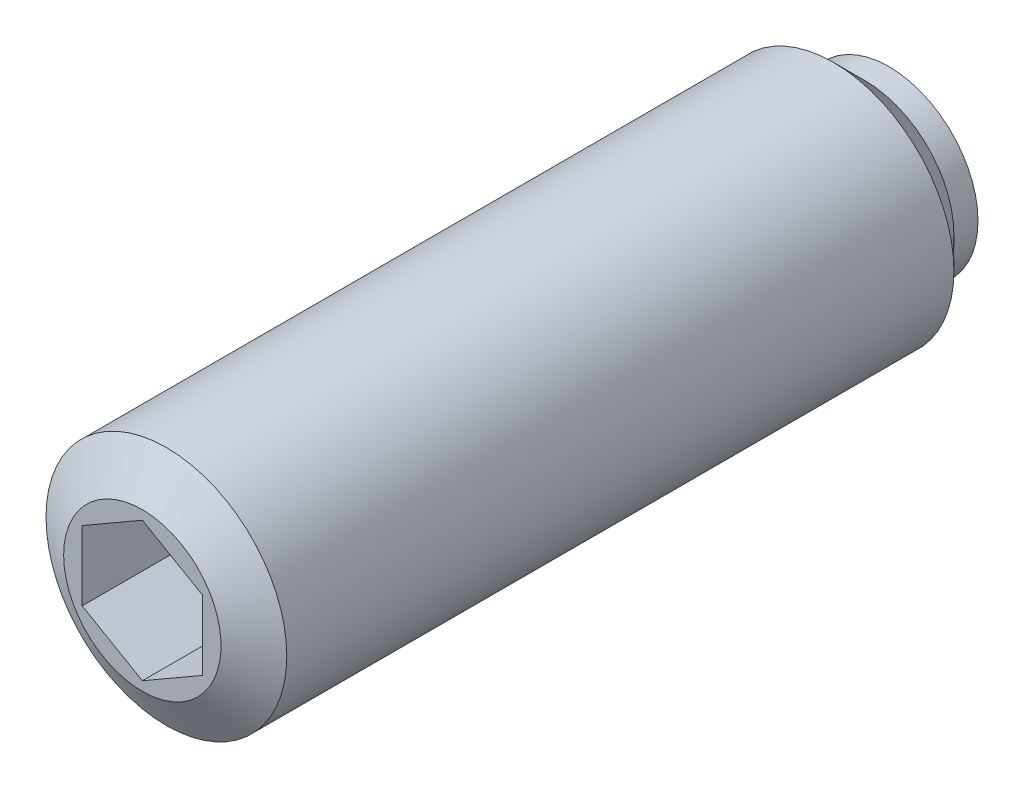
ISO-10303-21;
HEADER;
FILE_DESCRIPTION(('STEP AP214'),'2;1');
FILE_NAME('part.step','',(''),(''),'','','');
FILE_SCHEMA(('AUTOMOTIVE_DESIGN { 1 0 10303 214 1 1 1 1 }'));
ENDSEC;
DATA;
#1=APPLICATION_CONTEXT('core data for automotive mechanical design processes');
#2=APPLICATION_PROTOCOL_DEFINITION('international standard','automotive_design',2000,#1);
#3=PRODUCT_CONTEXT('',#1,'mechanical');
#4=PRODUCT('Part','Part','',(#3));
#5=PRODUCT_RELATED_PRODUCT_CATEGORY('part','',(#4));
#6=PRODUCT_DEFINITION_FORMATION('','',#4);
#7=PRODUCT_DEFINITION_CONTEXT('part definition',#1,'design');
#8=PRODUCT_DEFINITION('design','',#6,#7);
#9=PRODUCT_DEFINITION_SHAPE('','',#8);
#10=(LENGTH_UNIT() NAMED_UNIT(*) SI_UNIT(.MILLI.,.METRE.));
#11=(NAMED_UNIT(*) PLANE_ANGLE_UNIT() SI_UNIT($,.RADIAN.));
#12=(NAMED_UNIT(*) SI_UNIT($,.STERADIAN.) SOLID_ANGLE_UNIT());
#13=UNCERTAINTY_MEASURE_WITH_UNIT(LENGTH_MEASURE(1.E-05),#10,'distance_accuracy_value','');
#14=(GEOMETRIC_REPRESENTATION_CONTEXT(3) GLOBAL_UNCERTAINTY_ASSIGNED_CONTEXT((#13)) GLOBAL_UNIT_ASSIGNED_CONTEXT((#10,
#11,#12)) REPRESENTATION_CONTEXT('',''));
#15=CARTESIAN_POINT('',(0.,0.,0.));
#16=DIRECTION('',(0.,0.,1.));
#17=DIRECTION('',(1.,0.,0.));
#18=AXIS2_PLACEMENT_3D('',#15,#16,#17);
#19=CARTESIAN_POINT('',(0.,1.01980390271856,0.));
#20=DIRECTION('',(0.,0.,1.));
#21=DIRECTION('',(-1.,0.,0.));
#22=AXIS2_PLACEMENT_3D('',#19,#20,#21);
#23=PLANE('',#22);
#24=CARTESIAN_POINT('',(0.,0.,0.));
#25=DIRECTION('',(0.,0.,1.));
#26=DIRECTION('',(-1.,0.,0.));
#27=AXIS2_PLACEMENT_3D('',#24,#25,#26);
#28=CIRCLE('',#27,1.01980390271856);
#29=CARTESIAN_POINT('',(0.,1.01980390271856,0.));
#30=VERTEX_POINT('',#29);
#31=EDGE_CURVE('E9',#30,#30,#28,.T.);
#32=ORIENTED_EDGE('',*,*,#31,.F.);
#33=EDGE_LOOP('',(#32));
#34=FACE_BOUND('',#33,.T.);
#35=ADVANCED_FACE('F14',(#34),#23,.F.);
#36=CARTESIAN_POINT('',(0.,0.,1.1));
#37=DIRECTION('',(0.,0.,1.));
#38=DIRECTION('',(0.,1.,0.));
#39=AXIS2_PLACEMENT_3D('',#36,#37,#38);
#40=SPHERICAL_SURFACE('',#39,1.5);
#41=CARTESIAN_POINT('',(0.,0.,0.3));
#42=DIRECTION('',(0.,0.,1.));
#43=DIRECTION('',(-1.,0.,0.));
#44=AXIS2_PLACEMENT_3D('',#41,#42,#43);
#45=CIRCLE('',#44,1.26885775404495);
#46=CARTESIAN_POINT('',(0.,1.26885775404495,0.3));
#47=VERTEX_POINT('',#46);
#48=EDGE_CURVE('E21',#47,#47,#45,.T.);
#49=CARTESIAN_POINT('',(0.,1.26885775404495,0.3));
#50=CARTESIAN_POINT('',(0.,1.26668545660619,0.296554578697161));
#51=CARTESIAN_POINT('',(0.,1.26449912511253,0.293118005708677));
#52=CARTESIAN_POINT('',(0.,1.26009854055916,0.286262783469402));
#53=CARTESIAN_POINT('',(0.,1.25788428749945,0.28284413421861));
#54=CARTESIAN_POINT('',(0.,1.25342800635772,0.276024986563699));
#55=CARTESIAN_POINT('',(0.,1.2511859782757,0.27262448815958));
#56=CARTESIAN_POINT('',(0.,1.24667429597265,0.265841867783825));
#57=CARTESIAN_POINT('',(0.,1.24440464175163,0.26245974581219));
#58=CARTESIAN_POINT('',(0.,1.23983785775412,0.255714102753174));
#59=CARTESIAN_POINT('',(0.,1.23754072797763,0.252350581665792));
#60=CARTESIAN_POINT('',(0.,1.23291914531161,0.245642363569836));
#61=CARTESIAN_POINT('',(0.,1.23059469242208,0.242297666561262));
#62=CARTESIAN_POINT('',(0.,1.22591861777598,0.235627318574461));
#63=CARTESIAN_POINT('',(0.,1.2235669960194,0.232301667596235));
#64=CARTESIAN_POINT('',(0.,1.21883673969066,0.225669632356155));
#65=CARTESIAN_POINT('',(0.,1.2164581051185,0.222363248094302));
#66=CARTESIAN_POINT('',(0.,1.21167398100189,0.215769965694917));
#67=CARTESIAN_POINT('',(0.,1.20926849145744,0.212483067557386));
#68=CARTESIAN_POINT('',(0.,1.20443081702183,0.205928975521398));
#69=CARTESIAN_POINT('',(0.,1.20199863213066,0.202661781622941));
#70=CARTESIAN_POINT('',(0.,1.19710772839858,0.196147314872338));
#71=CARTESIAN_POINT('',(0.,1.19464900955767,0.192900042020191));
#72=CARTESIAN_POINT('',(0.,1.18970520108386,0.186425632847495));
#73=CARTESIAN_POINT('',(0.,1.18722011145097,0.183198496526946));
#74=CARTESIAN_POINT('',(0.,1.18222372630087,0.176764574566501));
#75=CARTESIAN_POINT('',(0.,1.17971243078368,0.173557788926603));
#76=CARTESIAN_POINT('',(0.,1.17466380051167,0.167164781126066));
#77=CARTESIAN_POINT('',(0.,1.17212646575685,0.163978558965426));
#78=CARTESIAN_POINT('',(0.,1.16702592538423,0.157626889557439));
#79=CARTESIAN_POINT('',(0.,1.16446271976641,0.154461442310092));
#80=CARTESIAN_POINT('',(0.,1.15931060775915,0.148151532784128));
#81=CARTESIAN_POINT('',(0.,1.15672170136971,0.145007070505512));
#82=CARTESIAN_POINT('',(0.,1.15151835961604,0.138739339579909));
#83=CARTESIAN_POINT('',(0.,1.14890392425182,0.135616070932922));
#84=CARTESIAN_POINT('',(0.,1.14364969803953,0.129390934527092));
#85=CARTESIAN_POINT('',(0.,1.14100990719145,0.126289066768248));
#86=CARTESIAN_POINT('',(0.,1.13570514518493,0.120106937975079));
#87=CARTESIAN_POINT('',(0.,1.13304017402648,0.117026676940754));
#88=CARTESIAN_POINT('',(0.,1.12768522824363,0.1108879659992));
#89=CARTESIAN_POINT('',(0.,1.12499525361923,0.107829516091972));
#90=CARTESIAN_POINT('',(0.,1.1195904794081,0.101734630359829));
#91=CARTESIAN_POINT('',(0.,1.11687567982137,0.0986981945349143));
#92=CARTESIAN_POINT('',(0.,1.11142143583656,0.0926475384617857));
#93=CARTESIAN_POINT('',(0.,1.10868199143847,0.0896333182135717));
#94=CARTESIAN_POINT('',(0.,1.10317863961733,0.0836272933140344));
#95=CARTESIAN_POINT('',(0.,1.10041473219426,0.080635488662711));
#96=CARTESIAN_POINT('',(0.,1.09486263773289,0.0746744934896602));
#97=CARTESIAN_POINT('',(0.,1.09207445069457,0.0717053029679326));
#98=CARTESIAN_POINT('',(0.,1.08647398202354,0.0657897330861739));
#99=CARTESIAN_POINT('',(0.,1.08366170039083,0.0628433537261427));
#100=CARTESIAN_POINT('',(0.,1.07801322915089,0.0569736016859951));
#101=CARTESIAN_POINT('',(0.,1.07517703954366,0.0540502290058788));
#102=CARTESIAN_POINT('',(0.,1.06948094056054,0.0482266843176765));
#103=CARTESIAN_POINT('',(0.,1.06662103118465,0.0453265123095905));
#104=CARTESIAN_POINT('',(0.,1.06087768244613,0.0395495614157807));
#105=CARTESIAN_POINT('',(0.,1.0579942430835,0.036672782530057));
#106=CARTESIAN_POINT('',(0.,1.0522040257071,0.0309428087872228));
#107=CARTESIAN_POINT('',(0.,1.04929724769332,0.0280896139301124));
#108=CARTESIAN_POINT('',(0.,1.04346054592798,0.0224069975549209));
#109=CARTESIAN_POINT('',(0.,1.0405306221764,0.01957757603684));
#110=CARTESIAN_POINT('',(0.,1.03464782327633,0.013942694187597));
#111=CARTESIAN_POINT('',(0.,1.03169494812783,0.011137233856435));
#112=CARTESIAN_POINT('',(0.,1.02576644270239,0.00555046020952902));
#113=CARTESIAN_POINT('',(0.,1.02279081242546,0.00276914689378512));
#114=CARTESIAN_POINT('',(0.,1.01980390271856,0.));
#115=B_SPLINE_CURVE_WITH_KNOTS('',3,(#49,#50,#51,#52,#53,#54,#55,#56,#57,#58,#59,#60,#61,#62,
#63,#64,#65,#66,#67,#68,#69,#70,#71,#72,#73,#74,#75,#76,#77,#78,#79,#80,#81,#82,#83,#84,#85,#86,
#87,#88,#89,#90,#91,#92,#93,#94,#95,#96,#97,#98,#99,#100,#101,#102,#103,#104,#105,#106,#107,
#108,#109,#110,#111,#112,#113,#114),.UNSPECIFIED.,.F.,.F.,(4,2,2,2,2,2,2,2,2,2,2,2,2,2,2,2,2,2,
2,2,2,2,2,2,2,2,2,2,2,2,2,2,4),(0.,0.0122191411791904,0.0244382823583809,0.0366574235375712,
0.0488765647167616,0.061095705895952,0.0733148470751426,0.0855339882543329,0.0977531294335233,
0.109972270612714,0.122191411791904,0.134410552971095,0.146629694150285,0.158848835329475,
0.171067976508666,0.183287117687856,0.195506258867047,0.207725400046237,0.219944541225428,
0.232163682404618,0.244382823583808,0.256601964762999,0.268821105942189,0.281040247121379,
0.29325938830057,0.30547852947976,0.317697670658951,0.329916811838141,0.342135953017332,
0.354355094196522,0.366574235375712,0.378793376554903,0.391012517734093),.UNSPECIFIED.);
#116=EDGE_CURVE('BSEAM141',#47,#30,#115,.T.);
#117=ORIENTED_EDGE('',*,*,#48,.F.);
#118=ORIENTED_EDGE('',*,*,#31,.T.);
#119=ORIENTED_EDGE('',*,*,#116,.T.);
#120=ORIENTED_EDGE('',*,*,#116,.F.);
#121=EDGE_LOOP('',(#117,#119,#118,#120));
#122=FACE_BOUND('',#121,.T.);
#123=ADVANCED_FACE('F141',(#122),#40,.T.);
#124=CARTESIAN_POINT('',(0.,1.85,0.3));
#125=DIRECTION('',(0.,0.,1.));
#126=DIRECTION('',(-1.,0.,0.));
#127=AXIS2_PLACEMENT_3D('',#124,#125,#126);
#128=PLANE('',#127);
#129=CARTESIAN_POINT('',(0.,0.,0.3));
#130=DIRECTION('',(0.,0.,1.));
#131=DIRECTION('',(-1.,0.,0.));
#132=AXIS2_PLACEMENT_3D('',#129,#130,#131);
#133=CIRCLE('',#132,1.85);
#134=CARTESIAN_POINT('',(-1.85,0.,0.3));
#135=VERTEX_POINT('',#134);
#136=EDGE_CURVE('E134',#135,#135,#133,.T.);
#137=ORIENTED_EDGE('',*,*,#136,.F.);
#138=EDGE_LOOP('',(#137));
#139=FACE_BOUND('',#138,.T.);
#140=ORIENTED_EDGE('',*,*,#48,.T.);
#141=EDGE_LOOP('',(#140));
#142=FACE_BOUND('',#141,.T.);
#143=ADVANCED_FACE('F139',(#139,#142),#128,.F.);
#144=CARTESIAN_POINT('',(0.,0.,17.1950749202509));
#145=DIRECTION('',(0.,0.,1.));
#146=DIRECTION('',(-1.,0.,0.));
#147=AXIS2_PLACEMENT_3D('',#144,#145,#146);
#148=CYLINDRICAL_SURFACE('',#147,1.85);
#149=CARTESIAN_POINT('',(0.,0.,0.8));
#150=DIRECTION('',(0.,0.,1.));
#151=DIRECTION('',(-1.,0.,0.));
#152=AXIS2_PLACEMENT_3D('',#149,#150,#151);
#153=CIRCLE('',#152,1.85);
#154=CARTESIAN_POINT('',(-1.85,0.,0.8));
#155=VERTEX_POINT('',#154);
#156=EDGE_CURVE('E131',#155,#155,#153,.T.);
#157=ORIENTED_EDGE('',*,*,#156,.F.);
#158=EDGE_LOOP('',(#157));
#159=FACE_BOUND('',#158,.T.);
#160=ORIENTED_EDGE('',*,*,#136,.T.);
#161=EDGE_LOOP('',(#160));
#162=FACE_BOUND('',#161,.T.);
#163=ADVANCED_FACE('F164',(#159,#162),#148,.T.);
#164=CARTESIAN_POINT('',(0.,0.,0.8));
#165=DIRECTION('',(0.,0.,1.));
#166=DIRECTION('',(-1.,0.,0.));
#167=AXIS2_PLACEMENT_3D('',#164,#165,#166);
#168=CONICAL_SURFACE('',#167,1.85,0.785398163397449);
#169=CARTESIAN_POINT('',(0.,0.,1.45));
#170=DIRECTION('',(0.,0.,1.));
#171=DIRECTION('',(-1.,0.,0.));
#172=AXIS2_PLACEMENT_3D('',#169,#170,#171);
#173=CIRCLE('',#172,2.5);
#174=CARTESIAN_POINT('',(-2.5,0.,1.45));
#175=VERTEX_POINT('',#174);
#176=EDGE_CURVE('E128',#175,#175,#173,.T.);
#177=ORIENTED_EDGE('',*,*,#176,.F.);
#178=EDGE_LOOP('',(#177));
#179=FACE_BOUND('',#178,.T.);
#180=ORIENTED_EDGE('',*,*,#156,.T.);
#181=EDGE_LOOP('',(#180));
#182=FACE_BOUND('',#181,.T.);
#183=ADVANCED_FACE('F173',(#179,#182),#168,.T.);
#184=CARTESIAN_POINT('',(0.,0.,17.1950749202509));
#185=DIRECTION('',(0.,0.,1.));
#186=DIRECTION('',(-1.,0.,0.));
#187=AXIS2_PLACEMENT_3D('',#184,#185,#186);
#188=CYLINDRICAL_SURFACE('',#187,2.5);
#189=CARTESIAN_POINT('',(0.,0.,15.3));
#190=DIRECTION('',(0.,0.,1.));
#191=DIRECTION('',(-1.,0.,0.));
#192=AXIS2_PLACEMENT_3D('',#189,#190,#191);
#193=CIRCLE('',#192,2.5);
#194=CARTESIAN_POINT('',(-2.5,0.,15.3));
#195=VERTEX_POINT('',#194);
#196=EDGE_CURVE('E125',#195,#195,#193,.T.);
#197=ORIENTED_EDGE('',*,*,#196,.F.);
#198=EDGE_LOOP('',(#197));
#199=FACE_BOUND('',#198,.T.);
#200=ORIENTED_EDGE('',*,*,#176,.T.);
#201=EDGE_LOOP('',(#200));
#202=FACE_BOUND('',#201,.T.);
#203=ADVANCED_FACE('F182',(#199,#202),#188,.T.);
#204=CARTESIAN_POINT('',(0.,0.,15.3));
#205=DIRECTION('',(0.,0.,-1.));
#206=DIRECTION('',(1.,0.,0.));
#207=AXIS2_PLACEMENT_3D('',#204,#205,#206);
#208=CONICAL_SURFACE('',#207,2.5,1.04719755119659);
#209=CARTESIAN_POINT('',(0.,0.,15.8));
#210=DIRECTION('',(0.,0.,1.));
#211=DIRECTION('',(-1.,0.,0.));
#212=AXIS2_PLACEMENT_3D('',#209,#210,#211);
#213=CIRCLE('',#212,1.63397459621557);
#214=CARTESIAN_POINT('',(-1.63397459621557,0.,15.8));
#215=VERTEX_POINT('',#214);
#216=EDGE_CURVE('E116',#215,#215,#213,.T.);
#217=ORIENTED_EDGE('',*,*,#216,.F.);
#218=EDGE_LOOP('',(#217));
#219=FACE_BOUND('',#218,.T.);
#220=ORIENTED_EDGE('',*,*,#196,.T.);
#221=EDGE_LOOP('',(#220));
#222=FACE_BOUND('',#221,.T.);
#223=ADVANCED_FACE('F191',(#219,#222),#208,.T.);
#224=CARTESIAN_POINT('',(0.,0.,15.8));
#225=DIRECTION('',(0.,0.,-1.));
#226=DIRECTION('',(1.,0.,0.));
#227=AXIS2_PLACEMENT_3D('',#224,#225,#226);
#228=PLANE('',#227);
#229=DIRECTION('',(-0.866025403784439,-0.5,0.));
#230=VECTOR('',#229,1.);
#231=CARTESIAN_POINT('',(0.,1.44337567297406,15.8));
#232=LINE('',#231,#230);
#233=CARTESIAN_POINT('',(0.,1.44337567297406,15.8));
#234=VERTEX_POINT('',#233);
#235=CARTESIAN_POINT('',(-1.25,0.721687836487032,15.8));
#236=VERTEX_POINT('',#235);
#237=EDGE_CURVE('E82',#234,#236,#232,.T.);
#238=ORIENTED_EDGE('',*,*,#237,.F.);
#239=DIRECTION('',(-0.866025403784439,0.5,0.));
#240=VECTOR('',#239,1.);
#241=CARTESIAN_POINT('',(1.25,0.721687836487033,15.8));
#242=LINE('',#241,#240);
#243=CARTESIAN_POINT('',(1.25,0.721687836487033,15.8));
#244=VERTEX_POINT('',#243);
#245=EDGE_CURVE('E28',#244,#234,#242,.T.);
#246=ORIENTED_EDGE('',*,*,#245,.F.);
#247=DIRECTION('',(0.,1.,0.));
#248=VECTOR('',#247,1.);
#249=CARTESIAN_POINT('',(1.25,-0.721687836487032,15.8));
#250=LINE('',#249,#248);
#251=CARTESIAN_POINT('',(1.25,-0.721687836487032,15.8));
#252=VERTEX_POINT('',#251);
#253=EDGE_CURVE('E98',#252,#244,#250,.T.);
#254=ORIENTED_EDGE('',*,*,#253,.F.);
#255=DIRECTION('',(0.866025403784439,0.5,0.));
#256=VECTOR('',#255,1.);
#257=CARTESIAN_POINT('',(0.,-1.44337567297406,15.8));
#258=LINE('',#257,#256);
#259=CARTESIAN_POINT('',(0.,-1.44337567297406,15.8));
#260=VERTEX_POINT('',#259);
#261=EDGE_CURVE('E92',#260,#252,#258,.T.);
#262=ORIENTED_EDGE('',*,*,#261,.F.);
#263=DIRECTION('',(0.866025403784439,-0.5,0.));
#264=VECTOR('',#263,1.);
#265=CARTESIAN_POINT('',(-1.25,-0.721687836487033,15.8));
#266=LINE('',#265,#264);
#267=CARTESIAN_POINT('',(-1.25,-0.721687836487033,15.8));
#268=VERTEX_POINT('',#267);
#269=EDGE_CURVE('E90',#268,#260,#266,.T.);
#270=ORIENTED_EDGE('',*,*,#269,.F.);
#271=DIRECTION('',(0.,-1.,0.));
#272=VECTOR('',#271,1.);
#273=CARTESIAN_POINT('',(-1.25,0.721687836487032,15.8));
#274=LINE('',#273,#272);
#275=EDGE_CURVE('E71',#236,#268,#274,.T.);
#276=ORIENTED_EDGE('',*,*,#275,.F.);
#277=EDGE_LOOP('',(#238,#246,#254,#262,#270,#276));
#278=FACE_BOUND('',#277,.T.);
#279=ORIENTED_EDGE('',*,*,#216,.T.);
#280=EDGE_LOOP('',(#279));
#281=FACE_BOUND('',#280,.T.);
#282=ADVANCED_FACE('F86',(#278,#281),#228,.F.);
#283=CARTESIAN_POINT('',(1.25,0.721687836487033,12.8));
#284=DIRECTION('',(0.5,0.866025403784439,0.));
#285=DIRECTION('',(0.866025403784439,-0.5,0.));
#286=AXIS2_PLACEMENT_3D('',#283,#284,#285);
#287=PLANE('',#286);
#288=ORIENTED_EDGE('',*,*,#245,.T.);
#289=DIRECTION('',(0.,0.,1.));
#290=VECTOR('',#289,1.);
#291=CARTESIAN_POINT('',(0.,1.44337567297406,12.8));
#292=LINE('',#291,#290);
#293=CARTESIAN_POINT('',(0.,1.44337567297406,12.8));
#294=VERTEX_POINT('',#293);
#295=EDGE_CURVE('E79',#294,#234,#292,.T.);
#296=ORIENTED_EDGE('',*,*,#295,.F.);
#297=DIRECTION('',(-0.866025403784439,0.5,0.));
#298=VECTOR('',#297,1.);
#299=CARTESIAN_POINT('',(1.25,0.721687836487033,12.8));
#300=LINE('',#299,#298);
#301=CARTESIAN_POINT('',(1.25,0.721687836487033,12.8));
#302=VERTEX_POINT('',#301);
#303=EDGE_CURVE('E100',#302,#294,#300,.T.);
#304=ORIENTED_EDGE('',*,*,#303,.F.);
#305=DIRECTION('',(0.,0.,1.));
#306=VECTOR('',#305,1.);
#307=CARTESIAN_POINT('',(1.25,0.721687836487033,12.8));
#308=LINE('',#307,#306);
#309=EDGE_CURVE('E35',#302,#244,#308,.T.);
#310=ORIENTED_EDGE('',*,*,#309,.T.);
#311=EDGE_LOOP('',(#288,#296,#304,#310));
#312=FACE_BOUND('',#311,.T.);
#313=ADVANCED_FACE('F208',(#312),#287,.F.);
#314=CARTESIAN_POINT('',(1.25,-0.721687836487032,12.8));
#315=DIRECTION('',(1.,0.,0.));
#316=DIRECTION('',(0.,-1.,0.));
#317=AXIS2_PLACEMENT_3D('',#314,#315,#316);
#318=PLANE('',#317);
#319=ORIENTED_EDGE('',*,*,#253,.T.);
#320=ORIENTED_EDGE('',*,*,#309,.F.);
#321=DIRECTION('',(0.,1.,0.));
#322=VECTOR('',#321,1.);
#323=CARTESIAN_POINT('',(1.25,-0.721687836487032,12.8));
#324=LINE('',#323,#322);
#325=CARTESIAN_POINT('',(1.25,-0.721687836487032,12.8));
#326=VERTEX_POINT('',#325);
#327=EDGE_CURVE('E112',#326,#302,#324,.T.);
#328=ORIENTED_EDGE('',*,*,#327,.F.);
#329=DIRECTION('',(0.,0.,1.));
#330=VECTOR('',#329,1.);
#331=CARTESIAN_POINT('',(1.25,-0.721687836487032,12.8));
#332=LINE('',#331,#330);
#333=EDGE_CURVE('E117',#326,#252,#332,.T.);
#334=ORIENTED_EDGE('',*,*,#333,.T.);
#335=EDGE_LOOP('',(#319,#320,#328,#334));
#336=FACE_BOUND('',#335,.T.);
#337=ADVANCED_FACE('F216',(#336),#318,.F.);
#338=CARTESIAN_POINT('',(0.,-1.44337567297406,12.8));
#339=DIRECTION('',(0.5,-0.866025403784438,0.));
#340=DIRECTION('',(-0.866025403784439,-0.5,0.));
#341=AXIS2_PLACEMENT_3D('',#338,#339,#340);
#342=PLANE('',#341);
#343=ORIENTED_EDGE('',*,*,#261,.T.);
#344=ORIENTED_EDGE('',*,*,#333,.F.);
#345=DIRECTION('',(0.866025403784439,0.5,0.));
#346=VECTOR('',#345,1.);
#347=CARTESIAN_POINT('',(0.,-1.44337567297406,12.8));
#348=LINE('',#347,#346);
#349=CARTESIAN_POINT('',(0.,-1.44337567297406,12.8));
#350=VERTEX_POINT('',#349);
#351=EDGE_CURVE('E109',#350,#326,#348,.T.);
#352=ORIENTED_EDGE('',*,*,#351,.F.);
#353=DIRECTION('',(0.,0.,1.));
#354=VECTOR('',#353,1.);
#355=CARTESIAN_POINT('',(0.,-1.44337567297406,12.8));
#356=LINE('',#355,#354);
#357=EDGE_CURVE('E119',#350,#260,#356,.T.);
#358=ORIENTED_EDGE('',*,*,#357,.T.);
#359=EDGE_LOOP('',(#343,#344,#352,#358));
#360=FACE_BOUND('',#359,.T.);
#361=ADVANCED_FACE('F224',(#360),#342,.F.);
#362=CARTESIAN_POINT('',(-1.25,-0.721687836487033,12.8));
#363=DIRECTION('',(-0.5,-0.866025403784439,0.));
#364=DIRECTION('',(-0.866025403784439,0.5,0.));
#365=AXIS2_PLACEMENT_3D('',#362,#363,#364);
#366=PLANE('',#365);
#367=ORIENTED_EDGE('',*,*,#269,.T.);
#368=ORIENTED_EDGE('',*,*,#357,.F.);
#369=DIRECTION('',(0.866025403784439,-0.5,0.));
#370=VECTOR('',#369,1.);
#371=CARTESIAN_POINT('',(-1.25,-0.721687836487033,12.8));
#372=LINE('',#371,#370);
#373=CARTESIAN_POINT('',(-1.25,-0.721687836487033,12.8));
#374=VERTEX_POINT('',#373);
#375=EDGE_CURVE('E106',#374,#350,#372,.T.);
#376=ORIENTED_EDGE('',*,*,#375,.F.);
#377=DIRECTION('',(0.,0.,1.));
#378=VECTOR('',#377,1.);
#379=CARTESIAN_POINT('',(-1.25,-0.721687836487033,12.8));
#380=LINE('',#379,#378);
#381=EDGE_CURVE('E78',#374,#268,#380,.T.);
#382=ORIENTED_EDGE('',*,*,#381,.T.);
#383=EDGE_LOOP('',(#367,#368,#376,#382));
#384=FACE_BOUND('',#383,.T.);
#385=ADVANCED_FACE('F232',(#384),#366,.F.);
#386=CARTESIAN_POINT('',(-1.25,0.721687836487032,12.8));
#387=DIRECTION('',(-1.,0.,0.));
#388=DIRECTION('',(0.,1.,0.));
#389=AXIS2_PLACEMENT_3D('',#386,#387,#388);
#390=PLANE('',#389);
#391=ORIENTED_EDGE('',*,*,#275,.T.);
#392=ORIENTED_EDGE('',*,*,#381,.F.);
#393=DIRECTION('',(0.,-1.,0.));
#394=VECTOR('',#393,1.);
#395=CARTESIAN_POINT('',(-1.25,0.721687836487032,12.8));
#396=LINE('',#395,#394);
#397=CARTESIAN_POINT('',(-1.25,0.721687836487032,12.8));
#398=VERTEX_POINT('',#397);
#399=EDGE_CURVE('E74',#398,#374,#396,.T.);
#400=ORIENTED_EDGE('',*,*,#399,.F.);
#401=DIRECTION('',(0.,0.,1.));
#402=VECTOR('',#401,1.);
#403=CARTESIAN_POINT('',(-1.25,0.721687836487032,12.8));
#404=LINE('',#403,#402);
#405=EDGE_CURVE('E67',#398,#236,#404,.T.);
#406=ORIENTED_EDGE('',*,*,#405,.T.);
#407=EDGE_LOOP('',(#391,#392,#400,#406));
#408=FACE_BOUND('',#407,.T.);
#409=ADVANCED_FACE('F69',(#408),#390,.F.);
#410=CARTESIAN_POINT('',(0.,1.44337567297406,12.8));
#411=DIRECTION('',(-0.5,0.866025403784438,0.));
#412=DIRECTION('',(0.866025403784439,0.5,0.));
#413=AXIS2_PLACEMENT_3D('',#410,#411,#412);
#414=PLANE('',#413);
#415=ORIENTED_EDGE('',*,*,#237,.T.);
#416=ORIENTED_EDGE('',*,*,#405,.F.);
#417=DIRECTION('',(-0.866025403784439,-0.5,0.));
#418=VECTOR('',#417,1.);
#419=CARTESIAN_POINT('',(0.,1.44337567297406,12.8));
#420=LINE('',#419,#418);
#421=EDGE_CURVE('E103',#294,#398,#420,.T.);
#422=ORIENTED_EDGE('',*,*,#421,.F.);
#423=ORIENTED_EDGE('',*,*,#295,.T.);
#424=EDGE_LOOP('',(#415,#416,#422,#423));
#425=FACE_BOUND('',#424,.T.);
#426=ADVANCED_FACE('F83',(#425),#414,.F.);
#427=CARTESIAN_POINT('',(2.5,0.,12.8));
#428=DIRECTION('',(0.,0.,-1.));
#429=DIRECTION('',(1.,0.,0.));
#430=AXIS2_PLACEMENT_3D('',#427,#428,#429);
#431=PLANE('',#430);
#432=ORIENTED_EDGE('',*,*,#303,.T.);
#433=ORIENTED_EDGE('',*,*,#421,.T.);
#434=ORIENTED_EDGE('',*,*,#399,.T.);
#435=ORIENTED_EDGE('',*,*,#375,.T.);
#436=ORIENTED_EDGE('',*,*,#351,.T.);
#437=ORIENTED_EDGE('',*,*,#327,.T.);
#438=EDGE_LOOP('',(#432,#433,#434,#435,#436,#437));
#439=FACE_BOUND('',#438,.T.);
#440=ADVANCED_FACE('F256',(#439),#431,.F.);
#441=CLOSED_SHELL('',(#35,#123,#143,#163,#183,#203,#223,#282,#313,#337,#361,#385,#409,#426,#440));
#442=MANIFOLD_SOLID_BREP('B1',#441);
#443=ADVANCED_BREP_SHAPE_REPRESENTATION('',(#18,#442),#14);
#444=SHAPE_DEFINITION_REPRESENTATION(#9,#443);
ENDSEC;
END-ISO-10303-21;
